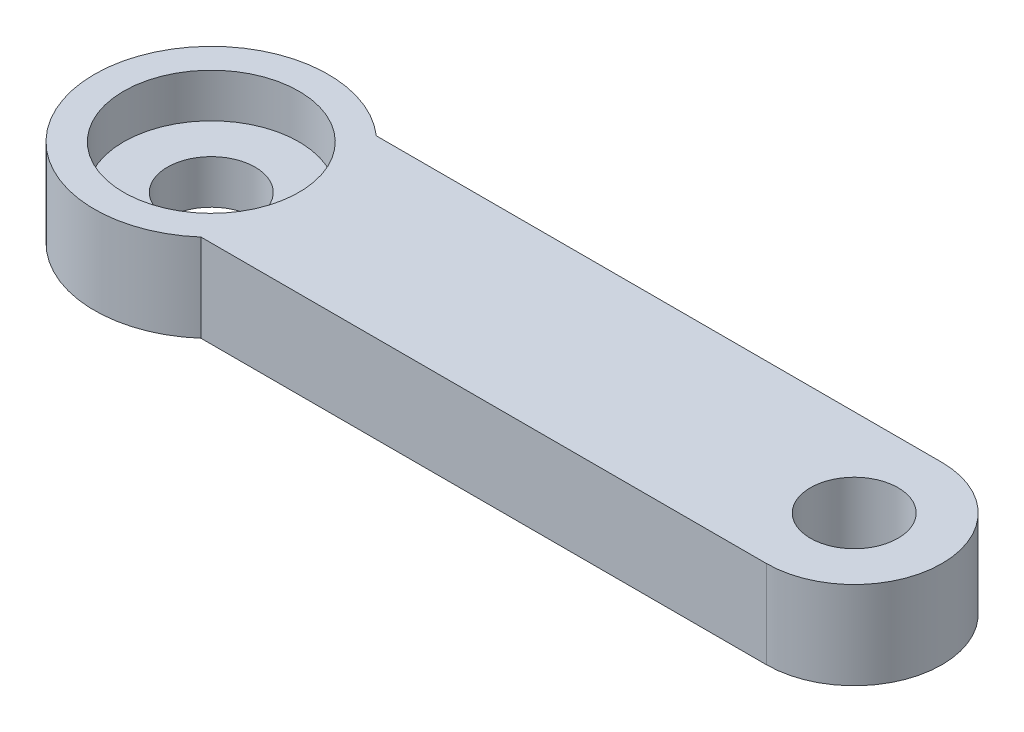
ISO-10303-21;
HEADER;
FILE_DESCRIPTION(('STEP AP214'),'2;1');
FILE_NAME('part.step','',(''),(''),'','','');
FILE_SCHEMA(('AUTOMOTIVE_DESIGN { 1 0 10303 214 1 1 1 1 }'));
ENDSEC;
DATA;
#1=APPLICATION_CONTEXT('core data for automotive mechanical design processes');
#2=APPLICATION_PROTOCOL_DEFINITION('international standard','automotive_design',2000,#1);
#3=PRODUCT_CONTEXT('',#1,'mechanical');
#4=PRODUCT('Part','Part','',(#3));
#5=PRODUCT_RELATED_PRODUCT_CATEGORY('part','',(#4));
#6=PRODUCT_DEFINITION_FORMATION('','',#4);
#7=PRODUCT_DEFINITION_CONTEXT('part definition',#1,'design');
#8=PRODUCT_DEFINITION('design','',#6,#7);
#9=PRODUCT_DEFINITION_SHAPE('','',#8);
#10=(LENGTH_UNIT() NAMED_UNIT(*) SI_UNIT(.MILLI.,.METRE.));
#11=(NAMED_UNIT(*) PLANE_ANGLE_UNIT() SI_UNIT($,.RADIAN.));
#12=(NAMED_UNIT(*) SI_UNIT($,.STERADIAN.) SOLID_ANGLE_UNIT());
#13=UNCERTAINTY_MEASURE_WITH_UNIT(LENGTH_MEASURE(1.E-05),#10,'distance_accuracy_value','');
#14=(GEOMETRIC_REPRESENTATION_CONTEXT(3) GLOBAL_UNCERTAINTY_ASSIGNED_CONTEXT((#13)) GLOBAL_UNIT_ASSIGNED_CONTEXT((#10,
#11,#12)) REPRESENTATION_CONTEXT('',''));
#15=CARTESIAN_POINT('',(0.,0.,0.));
#16=DIRECTION('',(0.,0.,1.));
#17=DIRECTION('',(1.,0.,0.));
#18=AXIS2_PLACEMENT_3D('',#15,#16,#17);
#19=CARTESIAN_POINT('',(0.,1.5,0.));
#20=DIRECTION('',(0.,1.,0.));
#21=DIRECTION('',(-1.,0.,0.));
#22=AXIS2_PLACEMENT_3D('',#19,#20,#21);
#23=CYLINDRICAL_SURFACE('',#22,3.);
#24=CARTESIAN_POINT('',(0.,3.,0.));
#25=DIRECTION('',(0.,1.,0.));
#26=DIRECTION('',(-1.,0.,0.));
#27=AXIS2_PLACEMENT_3D('',#24,#25,#26);
#28=CIRCLE('',#27,3.);
#29=CARTESIAN_POINT('',(-3.,3.,0.));
#30=VERTEX_POINT('',#29);
#31=EDGE_CURVE('E84',#30,#30,#28,.F.);
#32=ORIENTED_EDGE('',*,*,#31,.F.);
#33=EDGE_LOOP('',(#32));
#34=FACE_BOUND('',#33,.T.);
#35=CARTESIAN_POINT('',(0.,1.5,0.));
#36=DIRECTION('',(0.,1.,0.));
#37=DIRECTION('',(-1.,0.,0.));
#38=AXIS2_PLACEMENT_3D('',#35,#36,#37);
#39=CIRCLE('',#38,3.);
#40=CARTESIAN_POINT('',(-3.,1.5,0.));
#41=VERTEX_POINT('',#40);
#42=EDGE_CURVE('E20',#41,#41,#39,.T.);
#43=ORIENTED_EDGE('',*,*,#42,.F.);
#44=EDGE_LOOP('',(#43));
#45=FACE_BOUND('',#44,.T.);
#46=ADVANCED_FACE('F17',(#34,#45),#23,.F.);
#47=CARTESIAN_POINT('',(0.,1.5,0.));
#48=DIRECTION('',(0.,1.,0.));
#49=DIRECTION('',(-1.,0.,0.));
#50=AXIS2_PLACEMENT_3D('',#47,#48,#49);
#51=PLANE('',#50);
#52=ORIENTED_EDGE('',*,*,#42,.T.);
#53=EDGE_LOOP('',(#52));
#54=FACE_BOUND('',#53,.T.);
#55=CARTESIAN_POINT('',(0.,1.5,0.));
#56=DIRECTION('',(0.,-1.,0.));
#57=DIRECTION('',(1.,0.,0.));
#58=AXIS2_PLACEMENT_3D('',#55,#56,#57);
#59=CIRCLE('',#58,1.5);
#60=CARTESIAN_POINT('',(1.50000000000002,1.5,0.));
#61=VERTEX_POINT('',#60);
#62=EDGE_CURVE('E81',#61,#61,#59,.T.);
#63=ORIENTED_EDGE('',*,*,#62,.T.);
#64=EDGE_LOOP('',(#63));
#65=FACE_BOUND('',#64,.T.);
#66=ADVANCED_FACE('F106',(#54,#65),#51,.T.);
#67=CARTESIAN_POINT('',(0.,3.,0.));
#68=DIRECTION('',(0.,1.,0.));
#69=DIRECTION('',(-1.,0.,0.));
#70=AXIS2_PLACEMENT_3D('',#67,#68,#69);
#71=PLANE('',#70);
#72=CARTESIAN_POINT('',(22.,3.,0.));
#73=DIRECTION('',(0.,-1.,0.));
#74=DIRECTION('',(1.,0.,0.));
#75=AXIS2_PLACEMENT_3D('',#72,#73,#74);
#76=CIRCLE('',#75,1.5);
#77=CARTESIAN_POINT('',(23.5,3.,0.));
#78=VERTEX_POINT('',#77);
#79=EDGE_CURVE('E98',#78,#78,#76,.T.);
#80=ORIENTED_EDGE('',*,*,#79,.T.);
#81=EDGE_LOOP('',(#80));
#82=FACE_BOUND('',#81,.T.);
#83=CARTESIAN_POINT('',(22.,3.,0.));
#84=DIRECTION('',(0.,-1.,0.));
#85=DIRECTION('',(1.,0.,0.));
#86=AXIS2_PLACEMENT_3D('',#83,#84,#85);
#87=CIRCLE('',#86,3.);
#88=CARTESIAN_POINT('',(22.,3.,-3.00000000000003));
#89=VERTEX_POINT('',#88);
#90=CARTESIAN_POINT('',(22.,3.,2.99999999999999));
#91=VERTEX_POINT('',#90);
#92=EDGE_CURVE('E55',#89,#91,#87,.T.);
#93=ORIENTED_EDGE('',*,*,#92,.F.);
#94=DIRECTION('',(-1.,0.,0.));
#95=VECTOR('',#94,1.);
#96=CARTESIAN_POINT('',(0.,3.,-3.00000000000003));
#97=LINE('',#96,#95);
#98=CARTESIAN_POINT('',(2.64575131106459,3.,-3.00000000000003));
#99=VERTEX_POINT('',#98);
#100=EDGE_CURVE('E66',#99,#89,#97,.F.);
#101=ORIENTED_EDGE('',*,*,#100,.F.);
#102=CARTESIAN_POINT('',(0.,3.,0.));
#103=DIRECTION('',(0.,-1.,0.));
#104=DIRECTION('',(1.,0.,0.));
#105=AXIS2_PLACEMENT_3D('',#102,#103,#104);
#106=CIRCLE('',#105,4.00000000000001);
#107=CARTESIAN_POINT('',(2.6457513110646,3.,2.99999999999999));
#108=VERTEX_POINT('',#107);
#109=EDGE_CURVE('E60',#108,#99,#106,.T.);
#110=ORIENTED_EDGE('',*,*,#109,.F.);
#111=DIRECTION('',(-1.,0.,0.));
#112=VECTOR('',#111,1.);
#113=CARTESIAN_POINT('',(0.,3.,2.99999999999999));
#114=LINE('',#113,#112);
#115=EDGE_CURVE('E64',#108,#91,#114,.F.);
#116=ORIENTED_EDGE('',*,*,#115,.T.);
#117=EDGE_LOOP('',(#93,#101,#110,#116));
#118=FACE_BOUND('',#117,.T.);
#119=ORIENTED_EDGE('',*,*,#31,.T.);
#120=EDGE_LOOP('',(#119));
#121=FACE_BOUND('',#120,.T.);
#122=ADVANCED_FACE('F62',(#82,#118,#121),#71,.T.);
#123=CARTESIAN_POINT('',(0.,3.,0.));
#124=DIRECTION('',(0.,-1.,0.));
#125=DIRECTION('',(1.,0.,0.));
#126=AXIS2_PLACEMENT_3D('',#123,#124,#125);
#127=CYLINDRICAL_SURFACE('',#126,1.5);
#128=CARTESIAN_POINT('',(0.,0.,0.));
#129=DIRECTION('',(0.,-1.,0.));
#130=DIRECTION('',(1.,0.,0.));
#131=AXIS2_PLACEMENT_3D('',#128,#129,#130);
#132=CIRCLE('',#131,1.5);
#133=CARTESIAN_POINT('',(1.50000000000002,0.,0.));
#134=VERTEX_POINT('',#133);
#135=EDGE_CURVE('E95',#134,#134,#132,.T.);
#136=ORIENTED_EDGE('',*,*,#135,.T.);
#137=EDGE_LOOP('',(#136));
#138=FACE_BOUND('',#137,.T.);
#139=ORIENTED_EDGE('',*,*,#62,.F.);
#140=EDGE_LOOP('',(#139));
#141=FACE_BOUND('',#140,.T.);
#142=ADVANCED_FACE('F138',(#138,#141),#127,.F.);
#143=CARTESIAN_POINT('',(0.,3.,2.99999999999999));
#144=DIRECTION('',(0.,0.,-1.));
#145=DIRECTION('',(-1.,0.,0.));
#146=AXIS2_PLACEMENT_3D('',#143,#144,#145);
#147=PLANE('',#146);
#148=DIRECTION('',(0.,-1.,0.));
#149=VECTOR('',#148,1.);
#150=CARTESIAN_POINT('',(22.,3.,3.));
#151=LINE('',#150,#149);
#152=CARTESIAN_POINT('',(22.,0.,2.99999999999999));
#153=VERTEX_POINT('',#152);
#154=EDGE_CURVE('E78',#91,#153,#151,.T.);
#155=ORIENTED_EDGE('',*,*,#154,.F.);
#156=ORIENTED_EDGE('',*,*,#115,.F.);
#157=DIRECTION('',(0.,1.,0.));
#158=VECTOR('',#157,1.);
#159=CARTESIAN_POINT('',(2.64575131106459,3.,2.99999999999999));
#160=LINE('',#159,#158);
#161=CARTESIAN_POINT('',(2.6457513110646,0.,2.99999999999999));
#162=VERTEX_POINT('',#161);
#163=EDGE_CURVE('E77',#162,#108,#160,.T.);
#164=ORIENTED_EDGE('',*,*,#163,.F.);
#165=DIRECTION('',(-1.,0.,0.));
#166=VECTOR('',#165,1.);
#167=CARTESIAN_POINT('',(0.,0.,2.99999999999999));
#168=LINE('',#167,#166);
#169=EDGE_CURVE('E93',#162,#153,#168,.F.);
#170=ORIENTED_EDGE('',*,*,#169,.T.);
#171=EDGE_LOOP('',(#155,#156,#164,#170));
#172=FACE_BOUND('',#171,.T.);
#173=ADVANCED_FACE('F75',(#172),#147,.F.);
#174=CARTESIAN_POINT('',(22.,3.,0.));
#175=DIRECTION('',(0.,-1.,0.));
#176=DIRECTION('',(1.,0.,0.));
#177=AXIS2_PLACEMENT_3D('',#174,#175,#176);
#178=CYLINDRICAL_SURFACE('',#177,3.);
#179=ORIENTED_EDGE('',*,*,#92,.T.);
#180=ORIENTED_EDGE('',*,*,#154,.T.);
#181=CARTESIAN_POINT('',(22.,0.,0.));
#182=DIRECTION('',(0.,-1.,0.));
#183=DIRECTION('',(1.,0.,0.));
#184=AXIS2_PLACEMENT_3D('',#181,#182,#183);
#185=CIRCLE('',#184,3.);
#186=CARTESIAN_POINT('',(22.,0.,-3.00000000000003));
#187=VERTEX_POINT('',#186);
#188=EDGE_CURVE('E90',#153,#187,#185,.F.);
#189=ORIENTED_EDGE('',*,*,#188,.T.);
#190=DIRECTION('',(0.,1.,0.));
#191=VECTOR('',#190,1.);
#192=CARTESIAN_POINT('',(22.,3.,-3.00000000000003));
#193=LINE('',#192,#191);
#194=EDGE_CURVE('E71',#89,#187,#193,.F.);
#195=ORIENTED_EDGE('',*,*,#194,.F.);
#196=EDGE_LOOP('',(#179,#180,#189,#195));
#197=FACE_BOUND('',#196,.T.);
#198=ADVANCED_FACE('F132',(#197),#178,.T.);
#199=CARTESIAN_POINT('',(0.,3.,-3.00000000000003));
#200=DIRECTION('',(0.,0.,-1.));
#201=DIRECTION('',(-1.,0.,0.));
#202=AXIS2_PLACEMENT_3D('',#199,#200,#201);
#203=PLANE('',#202);
#204=ORIENTED_EDGE('',*,*,#100,.T.);
#205=ORIENTED_EDGE('',*,*,#194,.T.);
#206=DIRECTION('',(-1.,0.,0.));
#207=VECTOR('',#206,1.);
#208=CARTESIAN_POINT('',(0.,0.,-3.00000000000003));
#209=LINE('',#208,#207);
#210=CARTESIAN_POINT('',(2.64575131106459,0.,-3.00000000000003));
#211=VERTEX_POINT('',#210);
#212=EDGE_CURVE('E26',#187,#211,#209,.T.);
#213=ORIENTED_EDGE('',*,*,#212,.T.);
#214=DIRECTION('',(0.,-1.,0.));
#215=VECTOR('',#214,1.);
#216=CARTESIAN_POINT('',(2.64575131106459,3.,-3.00000000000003));
#217=LINE('',#216,#215);
#218=EDGE_CURVE('E70',#99,#211,#217,.T.);
#219=ORIENTED_EDGE('',*,*,#218,.F.);
#220=EDGE_LOOP('',(#204,#205,#213,#219));
#221=FACE_BOUND('',#220,.T.);
#222=ADVANCED_FACE('F129',(#221),#203,.T.);
#223=CARTESIAN_POINT('',(0.,3.,0.));
#224=DIRECTION('',(0.,-1.,0.));
#225=DIRECTION('',(1.,0.,0.));
#226=AXIS2_PLACEMENT_3D('',#223,#224,#225);
#227=CYLINDRICAL_SURFACE('',#226,4.00000000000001);
#228=ORIENTED_EDGE('',*,*,#218,.T.);
#229=CARTESIAN_POINT('',(0.,0.,0.));
#230=DIRECTION('',(0.,-1.,0.));
#231=DIRECTION('',(1.,0.,0.));
#232=AXIS2_PLACEMENT_3D('',#229,#230,#231);
#233=CIRCLE('',#232,4.00000000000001);
#234=EDGE_CURVE('E35',#211,#162,#233,.F.);
#235=ORIENTED_EDGE('',*,*,#234,.T.);
#236=ORIENTED_EDGE('',*,*,#163,.T.);
#237=ORIENTED_EDGE('',*,*,#109,.T.);
#238=EDGE_LOOP('',(#228,#235,#236,#237));
#239=FACE_BOUND('',#238,.T.);
#240=ADVANCED_FACE('F80',(#239),#227,.T.);
#241=CARTESIAN_POINT('',(22.,3.,0.));
#242=DIRECTION('',(0.,-1.,0.));
#243=DIRECTION('',(1.,0.,0.));
#244=AXIS2_PLACEMENT_3D('',#241,#242,#243);
#245=CYLINDRICAL_SURFACE('',#244,1.5);
#246=CARTESIAN_POINT('',(22.,0.,0.));
#247=DIRECTION('',(0.,-1.,0.));
#248=DIRECTION('',(1.,0.,0.));
#249=AXIS2_PLACEMENT_3D('',#246,#247,#248);
#250=CIRCLE('',#249,1.5);
#251=CARTESIAN_POINT('',(23.5,0.,0.));
#252=VERTEX_POINT('',#251);
#253=EDGE_CURVE('E11',#252,#252,#250,.T.);
#254=ORIENTED_EDGE('',*,*,#253,.T.);
#255=EDGE_LOOP('',(#254));
#256=FACE_BOUND('',#255,.T.);
#257=ORIENTED_EDGE('',*,*,#79,.F.);
#258=EDGE_LOOP('',(#257));
#259=FACE_BOUND('',#258,.T.);
#260=ADVANCED_FACE('F117',(#256,#259),#245,.F.);
#261=CARTESIAN_POINT('',(0.,0.,0.));
#262=DIRECTION('',(0.,1.,0.));
#263=DIRECTION('',(-1.,0.,0.));
#264=AXIS2_PLACEMENT_3D('',#261,#262,#263);
#265=PLANE('',#264);
#266=ORIENTED_EDGE('',*,*,#253,.F.);
#267=EDGE_LOOP('',(#266));
#268=FACE_BOUND('',#267,.T.);
#269=ORIENTED_EDGE('',*,*,#212,.F.);
#270=ORIENTED_EDGE('',*,*,#188,.F.);
#271=ORIENTED_EDGE('',*,*,#169,.F.);
#272=ORIENTED_EDGE('',*,*,#234,.F.);
#273=EDGE_LOOP('',(#269,#270,#271,#272));
#274=FACE_BOUND('',#273,.T.);
#275=ORIENTED_EDGE('',*,*,#135,.F.);
#276=EDGE_LOOP('',(#275));
#277=FACE_BOUND('',#276,.T.);
#278=ADVANCED_FACE('F115',(#268,#274,#277),#265,.F.);
#279=CLOSED_SHELL('',(#46,#66,#122,#142,#173,#198,#222,#240,#260,#278));
#280=MANIFOLD_SOLID_BREP('B1',#279);
#281=ADVANCED_BREP_SHAPE_REPRESENTATION('',(#18,#280),#14);
#282=SHAPE_DEFINITION_REPRESENTATION(#9,#281);
ENDSEC;
END-ISO-10303-21;
